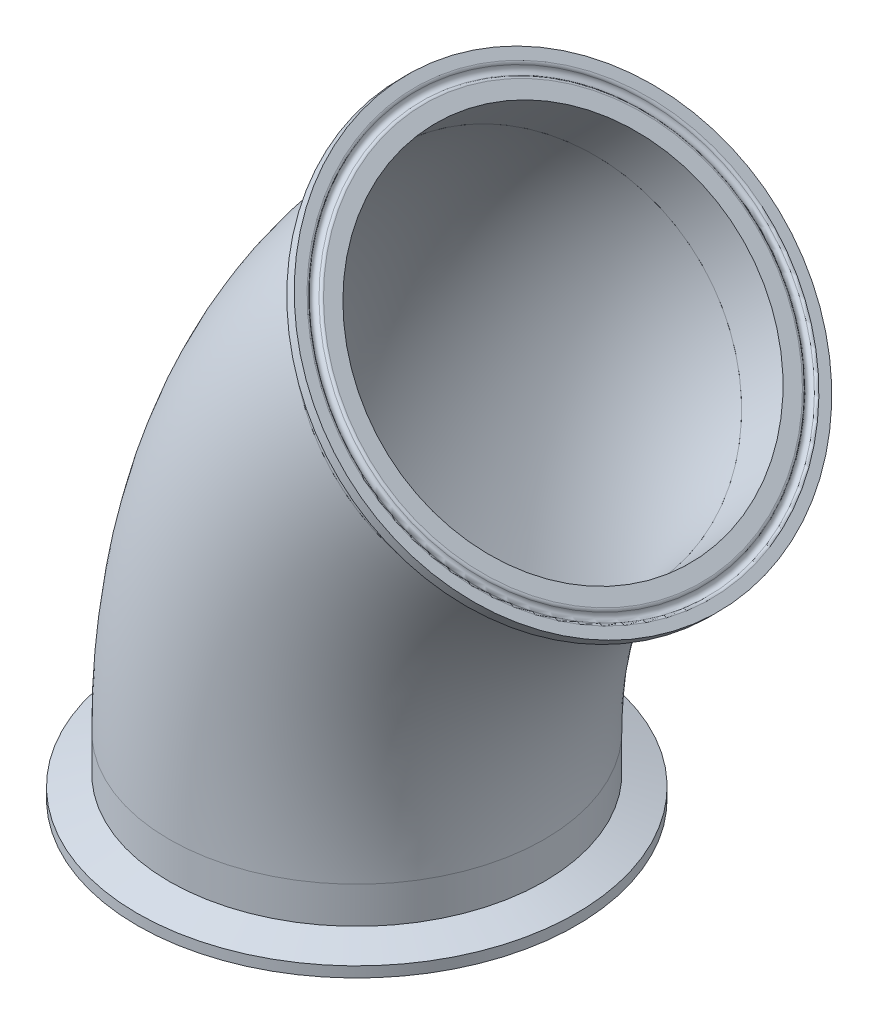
ISO-10303-21;
HEADER;
FILE_DESCRIPTION(('STEP AP214'),'2;1');
FILE_NAME('part.step','',(''),(''),'','','');
FILE_SCHEMA(('AUTOMOTIVE_DESIGN { 1 0 10303 214 1 1 1 1 }'));
ENDSEC;
DATA;
#1=APPLICATION_CONTEXT('core data for automotive mechanical design processes');
#2=APPLICATION_PROTOCOL_DEFINITION('international standard','automotive_design',2000,#1);
#3=PRODUCT_CONTEXT('',#1,'mechanical');
#4=PRODUCT('Part','Part','',(#3));
#5=PRODUCT_RELATED_PRODUCT_CATEGORY('part','',(#4));
#6=PRODUCT_DEFINITION_FORMATION('','',#4);
#7=PRODUCT_DEFINITION_CONTEXT('part definition',#1,'design');
#8=PRODUCT_DEFINITION('design','',#6,#7);
#9=PRODUCT_DEFINITION_SHAPE('','',#8);
#10=(LENGTH_UNIT() NAMED_UNIT(*) SI_UNIT(.MILLI.,.METRE.));
#11=(NAMED_UNIT(*) PLANE_ANGLE_UNIT() SI_UNIT($,.RADIAN.));
#12=(NAMED_UNIT(*) SI_UNIT($,.STERADIAN.) SOLID_ANGLE_UNIT());
#13=UNCERTAINTY_MEASURE_WITH_UNIT(LENGTH_MEASURE(1.E-05),#10,'distance_accuracy_value','');
#14=(GEOMETRIC_REPRESENTATION_CONTEXT(3) GLOBAL_UNCERTAINTY_ASSIGNED_CONTEXT((#13)) GLOBAL_UNIT_ASSIGNED_CONTEXT((#10,
#11,#12)) REPRESENTATION_CONTEXT('',''));
#15=CARTESIAN_POINT('',(0.,0.,0.));
#16=DIRECTION('',(0.,0.,1.));
#17=DIRECTION('',(1.,0.,0.));
#18=AXIS2_PLACEMENT_3D('',#15,#16,#17);
#19=CARTESIAN_POINT('',(86.4752113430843,123.154326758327,89.4574907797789));
#20=DIRECTION('',(0.707106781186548,0.707106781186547,0.));
#21=DIRECTION('',(0.70566039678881,-0.705660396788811,-0.063928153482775));
#22=AXIS2_PLACEMENT_3D('',#19,#20,#21);
#23=TOROIDAL_SURFACE('',#22,56.6185084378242,0.787400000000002);
#24=CARTESIAN_POINT('',(87.0319872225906,123.711102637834,89.4574907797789));
#25=DIRECTION('',(0.707106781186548,0.707106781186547,0.));
#26=DIRECTION('',(0.70566039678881,-0.705660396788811,-0.063928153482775));
#27=AXIS2_PLACEMENT_3D('',#24,#25,#26);
#28=CIRCLE('',#27,56.6185084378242);
#29=CARTESIAN_POINT('',(126.985426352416,83.7576635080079,85.8379740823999));
#30=VERTEX_POINT('',#29);
#31=EDGE_CURVE('P0_E48',#30,#30,#28,.T.);
#32=ORIENTED_EDGE('',*,*,#31,.T.);
#33=EDGE_LOOP('',(#32));
#34=FACE_BOUND('',#33,.T.);
#35=CARTESIAN_POINT('',(86.6964940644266,123.37560947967,89.4574907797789));
#36=DIRECTION('',(0.707106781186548,0.707106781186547,0.));
#37=DIRECTION('',(0.70566039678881,-0.705660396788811,-0.063928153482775));
#38=AXIS2_PLACEMENT_3D('',#35,#36,#37);
#39=CIRCLE('',#38,55.8959666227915);
#40=CARTESIAN_POINT('',(126.14006405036,83.9320394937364,85.8841648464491));
#41=VERTEX_POINT('',#40);
#42=EDGE_CURVE('P0_E9',#41,#41,#39,.T.);
#43=ORIENTED_EDGE('',*,*,#42,.F.);
#44=EDGE_LOOP('',(#43));
#45=FACE_BOUND('',#44,.T.);
#46=ADVANCED_FACE('P0_F14',(#34,#45),#23,.T.);
#47=CARTESIAN_POINT('',(87.0319872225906,123.711102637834,89.4574907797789));
#48=DIRECTION('',(0.707106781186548,0.707106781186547,0.));
#49=DIRECTION('',(0.70566039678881,-0.705660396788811,-0.063928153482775));
#50=AXIS2_PLACEMENT_3D('',#47,#48,#49);
#51=TOROIDAL_SURFACE('',#50,54.8005,1.1938);
#52=CARTESIAN_POINT('',(86.6964940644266,123.37560947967,89.4574907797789));
#53=DIRECTION('',(0.707106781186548,0.707106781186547,0.));
#54=DIRECTION('',(0.70566039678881,-0.705660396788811,-0.063928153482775));
#55=AXIS2_PLACEMENT_3D('',#52,#53,#54);
#56=CIRCLE('',#55,53.7050333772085);
#57=CARTESIAN_POINT('',(124.594009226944,85.4780943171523,86.0242271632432));
#58=VERTEX_POINT('',#57);
#59=EDGE_CURVE('P0_E20',#58,#58,#56,.T.);
#60=ORIENTED_EDGE('',*,*,#59,.F.);
#61=EDGE_LOOP('',(#60));
#62=FACE_BOUND('',#61,.T.);
#63=ORIENTED_EDGE('',*,*,#42,.T.);
#64=EDGE_LOOP('',(#63));
#65=FACE_BOUND('',#64,.T.);
#66=ADVANCED_FACE('P0_F97',(#62,#65),#51,.F.);
#67=CARTESIAN_POINT('',(86.4752113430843,123.154326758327,89.4574907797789));
#68=DIRECTION('',(0.707106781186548,0.707106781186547,0.));
#69=DIRECTION('',(0.70566039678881,-0.705660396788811,-0.063928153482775));
#70=AXIS2_PLACEMENT_3D('',#67,#68,#69);
#71=TOROIDAL_SURFACE('',#70,52.9824915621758,0.787399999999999);
#72=ORIENTED_EDGE('',*,*,#59,.T.);
#73=EDGE_LOOP('',(#72));
#74=FACE_BOUND('',#73,.T.);
#75=CARTESIAN_POINT('',(87.0319872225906,123.711102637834,89.4574907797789));
#76=DIRECTION('',(0.707106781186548,0.707106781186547,0.));
#77=DIRECTION('',(0.70566039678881,-0.705660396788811,-0.063928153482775));
#78=AXIS2_PLACEMENT_3D('',#75,#76,#77);
#79=CIRCLE('',#78,52.9824915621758);
#80=CARTESIAN_POINT('',(124.419633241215,86.3234566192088,86.0704179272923));
#81=VERTEX_POINT('',#80);
#82=EDGE_CURVE('P0_E24',#81,#81,#79,.T.);
#83=ORIENTED_EDGE('',*,*,#82,.F.);
#84=EDGE_LOOP('',(#83));
#85=FACE_BOUND('',#84,.T.);
#86=ADVANCED_FACE('P0_F93',(#74,#85),#71,.T.);
#87=CARTESIAN_POINT('',(87.0319872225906,123.711102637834,89.4574907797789));
#88=DIRECTION('',(-0.707106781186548,-0.707106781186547,0.));
#89=DIRECTION('',(-0.70566039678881,0.705660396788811,0.063928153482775));
#90=AXIS2_PLACEMENT_3D('',#87,#88,#89);
#91=PLANE('',#90);
#92=CARTESIAN_POINT('',(87.0319872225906,123.711102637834,89.4574907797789));
#93=DIRECTION('',(0.707106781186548,0.707106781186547,0.));
#94=DIRECTION('',(0.70566039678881,-0.705660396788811,-0.063928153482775));
#95=AXIS2_PLACEMENT_3D('',#92,#93,#94);
#96=CIRCLE('',#95,48.6918);
#97=CARTESIAN_POINT('',(121.391862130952,89.3512277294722,86.3447139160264));
#98=VERTEX_POINT('',#97);
#99=EDGE_CURVE('P0_E28',#98,#98,#96,.T.);
#100=ORIENTED_EDGE('',*,*,#99,.F.);
#101=EDGE_LOOP('',(#100));
#102=FACE_BOUND('',#101,.T.);
#103=ORIENTED_EDGE('',*,*,#82,.T.);
#104=EDGE_LOOP('',(#103));
#105=FACE_BOUND('',#104,.T.);
#106=ADVANCED_FACE('P0_F86',(#102,#105),#91,.F.);
#107=CARTESIAN_POINT('',(87.0319872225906,123.711102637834,89.4574907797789));
#108=DIRECTION('',(0.707106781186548,0.707106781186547,0.));
#109=DIRECTION('',(0.70566039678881,-0.705660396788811,-0.063928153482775));
#110=AXIS2_PLACEMENT_3D('',#107,#108,#109);
#111=CYLINDRICAL_SURFACE('',#110,48.6918);
#112=ORIENTED_EDGE('',*,*,#99,.T.);
#113=EDGE_LOOP('',(#112));
#114=FACE_BOUND('',#113,.T.);
#115=CARTESIAN_POINT('',(75.8066670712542,112.485782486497,89.4574907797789));
#116=DIRECTION('',(0.707106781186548,0.707106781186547,0.));
#117=DIRECTION('',(0.70566039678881,-0.705660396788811,-0.063928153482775));
#118=AXIS2_PLACEMENT_3D('',#115,#116,#117);
#119=CIRCLE('',#118,48.6918);
#120=CARTESIAN_POINT('',(110.166541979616,78.1259075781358,86.3447139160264));
#121=VERTEX_POINT('',#120);
#122=EDGE_CURVE('P0_E33',#121,#121,#119,.T.);
#123=ORIENTED_EDGE('',*,*,#122,.F.);
#124=EDGE_LOOP('',(#123));
#125=FACE_BOUND('',#124,.T.);
#126=ADVANCED_FACE('P0_F81',(#114,#125),#111,.F.);
#127=CARTESIAN_POINT('',(75.8066670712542,112.485782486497,89.4574907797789));
#128=DIRECTION('',(0.707106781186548,0.707106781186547,0.));
#129=DIRECTION('',(0.70566039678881,-0.705660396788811,-0.063928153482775));
#130=AXIS2_PLACEMENT_3D('',#127,#128,#129);
#131=PLANE('',#130);
#132=CARTESIAN_POINT('',(75.8066670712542,112.485782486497,89.4574907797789));
#133=DIRECTION('',(0.707106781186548,0.707106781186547,0.));
#134=DIRECTION('',(0.70566039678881,-0.705660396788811,-0.063928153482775));
#135=AXIS2_PLACEMENT_3D('',#132,#133,#134);
#136=CIRCLE('',#135,50.8);
#137=CARTESIAN_POINT('',(111.654215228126,76.6382343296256,86.209940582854));
#138=VERTEX_POINT('',#137);
#139=EDGE_CURVE('P0_E36',#138,#138,#136,.T.);
#140=ORIENTED_EDGE('',*,*,#139,.F.);
#141=EDGE_LOOP('',(#140));
#142=FACE_BOUND('',#141,.T.);
#143=ORIENTED_EDGE('',*,*,#122,.T.);
#144=EDGE_LOOP('',(#143));
#145=FACE_BOUND('',#144,.T.);
#146=ADVANCED_FACE('P0_F75',(#142,#145),#131,.F.);
#147=CARTESIAN_POINT('',(87.0319872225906,123.711102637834,89.4574907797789));
#148=DIRECTION('',(0.707106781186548,0.707106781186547,0.));
#149=DIRECTION('',(0.70566039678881,-0.705660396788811,-0.063928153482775));
#150=AXIS2_PLACEMENT_3D('',#147,#148,#149);
#151=CYLINDRICAL_SURFACE('',#150,50.8);
#152=CARTESIAN_POINT('',(82.7912615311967,119.47037694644,89.4574907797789));
#153=DIRECTION('',(0.707106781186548,0.707106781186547,0.));
#154=DIRECTION('',(0.70566039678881,-0.705660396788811,-0.063928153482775));
#155=AXIS2_PLACEMENT_3D('',#152,#153,#154);
#156=CIRCLE('',#155,50.8);
#157=CARTESIAN_POINT('',(118.638809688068,83.6228287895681,86.209940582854));
#158=VERTEX_POINT('',#157);
#159=EDGE_CURVE('P0_E39',#158,#158,#156,.T.);
#160=ORIENTED_EDGE('',*,*,#159,.F.);
#161=EDGE_LOOP('',(#160));
#162=FACE_BOUND('',#161,.T.);
#163=ORIENTED_EDGE('',*,*,#139,.T.);
#164=EDGE_LOOP('',(#163));
#165=FACE_BOUND('',#164,.T.);
#166=ADVANCED_FACE('P0_F69',(#162,#165),#151,.T.);
#167=CARTESIAN_POINT('',(82.7912615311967,119.47037694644,89.4574907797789));
#168=DIRECTION('',(0.707106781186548,0.707106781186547,0.));
#169=DIRECTION('',(0.70566039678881,-0.705660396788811,-0.063928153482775));
#170=AXIS2_PLACEMENT_3D('',#167,#168,#169);
#171=CONICAL_SURFACE('',#170,50.8,1.22173047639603);
#172=CARTESIAN_POINT('',(85.0204098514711,121.699525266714,89.4574907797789));
#173=DIRECTION('',(0.707106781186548,0.707106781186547,0.));
#174=DIRECTION('',(0.70566039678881,-0.705660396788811,-0.063928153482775));
#175=AXIS2_PLACEMENT_3D('',#172,#173,#174);
#176=CIRCLE('',#175,59.4614);
#177=CARTESIAN_POINT('',(126.979964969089,79.7399701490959,85.6562332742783));
#178=VERTEX_POINT('',#177);
#179=EDGE_CURVE('P0_E42',#178,#178,#176,.T.);
#180=ORIENTED_EDGE('',*,*,#179,.F.);
#181=EDGE_LOOP('',(#180));
#182=FACE_BOUND('',#181,.T.);
#183=ORIENTED_EDGE('',*,*,#159,.T.);
#184=EDGE_LOOP('',(#183));
#185=FACE_BOUND('',#184,.T.);
#186=ADVANCED_FACE('P0_F63',(#182,#185),#171,.T.);
#187=CARTESIAN_POINT('',(87.0319872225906,123.711102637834,89.4574907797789));
#188=DIRECTION('',(0.707106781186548,0.707106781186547,0.));
#189=DIRECTION('',(0.70566039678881,-0.705660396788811,-0.063928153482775));
#190=AXIS2_PLACEMENT_3D('',#187,#188,#189);
#191=CYLINDRICAL_SURFACE('',#190,59.4614);
#192=CARTESIAN_POINT('',(87.0319872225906,123.711102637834,89.4574907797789));
#193=DIRECTION('',(0.707106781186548,0.707106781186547,0.));
#194=DIRECTION('',(0.70566039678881,-0.705660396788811,-0.063928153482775));
#195=AXIS2_PLACEMENT_3D('',#192,#193,#194);
#196=CIRCLE('',#195,59.4614);
#197=CARTESIAN_POINT('',(128.991542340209,81.7515475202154,85.6562332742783));
#198=VERTEX_POINT('',#197);
#199=EDGE_CURVE('P0_E45',#198,#198,#196,.T.);
#200=ORIENTED_EDGE('',*,*,#199,.F.);
#201=EDGE_LOOP('',(#200));
#202=FACE_BOUND('',#201,.T.);
#203=ORIENTED_EDGE('',*,*,#179,.T.);
#204=EDGE_LOOP('',(#203));
#205=FACE_BOUND('',#204,.T.);
#206=ADVANCED_FACE('P0_F57',(#202,#205),#191,.T.);
#207=CARTESIAN_POINT('',(87.0319872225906,123.711102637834,89.4574907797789));
#208=DIRECTION('',(-0.707106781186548,-0.707106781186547,0.));
#209=DIRECTION('',(-0.70566039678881,0.705660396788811,0.063928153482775));
#210=AXIS2_PLACEMENT_3D('',#207,#208,#209);
#211=PLANE('',#210);
#212=ORIENTED_EDGE('',*,*,#31,.F.);
#213=EDGE_LOOP('',(#212));
#214=FACE_BOUND('',#213,.T.);
#215=ORIENTED_EDGE('',*,*,#199,.T.);
#216=EDGE_LOOP('',(#215));
#217=FACE_BOUND('',#216,.T.);
#218=ADVANCED_FACE('P0_F54',(#214,#217),#211,.F.);
#219=CLOSED_SHELL('',(#46,#66,#86,#106,#126,#146,#166,#186,#206,#218));
#220=MANIFOLD_SOLID_BREP('P0_B1',#219);
#221=CARTESIAN_POINT('',(31.1697405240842,-10.3648909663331,89.4574907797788));
#222=DIRECTION('',(0.,-1.,0.));
#223=DIRECTION('',(0.,0.,-1.));
#224=AXIS2_PLACEMENT_3D('',#221,#222,#223);
#225=TOROIDAL_SURFACE('',#224,56.6185084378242,0.787400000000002);
#226=CARTESIAN_POINT('',(31.1697405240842,-11.1522909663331,89.4574907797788));
#227=DIRECTION('',(0.,-1.,0.));
#228=DIRECTION('',(0.,0.,-1.));
#229=AXIS2_PLACEMENT_3D('',#226,#227,#228);
#230=CIRCLE('',#229,56.6185084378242);
#231=CARTESIAN_POINT('',(31.1697405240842,-11.1522909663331,32.8389823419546));
#232=VERTEX_POINT('',#231);
#233=EDGE_CURVE('P1_E49',#232,#232,#230,.T.);
#234=ORIENTED_EDGE('',*,*,#233,.T.);
#235=EDGE_LOOP('',(#234));
#236=FACE_BOUND('',#235,.T.);
#237=CARTESIAN_POINT('',(31.1697405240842,-10.6778319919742,89.4574907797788));
#238=DIRECTION('',(0.,-1.,0.));
#239=DIRECTION('',(0.,0.,-1.));
#240=AXIS2_PLACEMENT_3D('',#237,#238,#239);
#241=CIRCLE('',#240,55.8959666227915);
#242=CARTESIAN_POINT('',(31.1697405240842,-10.6778319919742,33.5615241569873));
#243=VERTEX_POINT('',#242);
#244=EDGE_CURVE('P1_E10',#243,#243,#241,.T.);
#245=ORIENTED_EDGE('',*,*,#244,.F.);
#246=EDGE_LOOP('',(#245));
#247=FACE_BOUND('',#246,.T.);
#248=ADVANCED_FACE('P1_F15',(#236,#247),#225,.T.);
#249=CARTESIAN_POINT('',(31.1697405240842,-11.1522909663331,89.4574907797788));
#250=DIRECTION('',(0.,-1.,0.));
#251=DIRECTION('',(0.,0.,-1.));
#252=AXIS2_PLACEMENT_3D('',#249,#250,#251);
#253=TOROIDAL_SURFACE('',#252,54.8005,1.1938);
#254=CARTESIAN_POINT('',(31.1697405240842,-10.6778319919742,89.4574907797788));
#255=DIRECTION('',(0.,-1.,0.));
#256=DIRECTION('',(0.,0.,-1.));
#257=AXIS2_PLACEMENT_3D('',#254,#255,#256);
#258=CIRCLE('',#257,53.7050333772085);
#259=CARTESIAN_POINT('',(31.1697405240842,-10.6778319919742,35.7524574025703));
#260=VERTEX_POINT('',#259);
#261=EDGE_CURVE('P1_E21',#260,#260,#258,.T.);
#262=ORIENTED_EDGE('',*,*,#261,.F.);
#263=EDGE_LOOP('',(#262));
#264=FACE_BOUND('',#263,.T.);
#265=ORIENTED_EDGE('',*,*,#244,.T.);
#266=EDGE_LOOP('',(#265));
#267=FACE_BOUND('',#266,.T.);
#268=ADVANCED_FACE('P1_F98',(#264,#267),#253,.F.);
#269=CARTESIAN_POINT('',(31.1697405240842,-10.3648909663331,89.4574907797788));
#270=DIRECTION('',(0.,-1.,0.));
#271=DIRECTION('',(0.,0.,-1.));
#272=AXIS2_PLACEMENT_3D('',#269,#270,#271);
#273=TOROIDAL_SURFACE('',#272,52.9824915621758,0.787399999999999);
#274=ORIENTED_EDGE('',*,*,#261,.T.);
#275=EDGE_LOOP('',(#274));
#276=FACE_BOUND('',#275,.T.);
#277=CARTESIAN_POINT('',(31.1697405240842,-11.1522909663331,89.4574907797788));
#278=DIRECTION('',(0.,-1.,0.));
#279=DIRECTION('',(0.,0.,-1.));
#280=AXIS2_PLACEMENT_3D('',#277,#278,#279);
#281=CIRCLE('',#280,52.9824915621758);
#282=CARTESIAN_POINT('',(31.1697405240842,-11.1522909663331,36.474999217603));
#283=VERTEX_POINT('',#282);
#284=EDGE_CURVE('P1_E25',#283,#283,#281,.T.);
#285=ORIENTED_EDGE('',*,*,#284,.F.);
#286=EDGE_LOOP('',(#285));
#287=FACE_BOUND('',#286,.T.);
#288=ADVANCED_FACE('P1_F94',(#276,#287),#273,.T.);
#289=CARTESIAN_POINT('',(31.1697405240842,-11.1522909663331,89.4574907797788));
#290=DIRECTION('',(0.,1.,0.));
#291=DIRECTION('',(0.,0.,1.));
#292=AXIS2_PLACEMENT_3D('',#289,#290,#291);
#293=PLANE('',#292);
#294=CARTESIAN_POINT('',(31.1697405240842,-11.1522909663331,89.4574907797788));
#295=DIRECTION('',(0.,-1.,0.));
#296=DIRECTION('',(0.,0.,-1.));
#297=AXIS2_PLACEMENT_3D('',#294,#295,#296);
#298=CIRCLE('',#297,48.6918);
#299=CARTESIAN_POINT('',(31.1697405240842,-11.1522909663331,40.7656907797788));
#300=VERTEX_POINT('',#299);
#301=EDGE_CURVE('P1_E29',#300,#300,#298,.T.);
#302=ORIENTED_EDGE('',*,*,#301,.F.);
#303=EDGE_LOOP('',(#302));
#304=FACE_BOUND('',#303,.T.);
#305=ORIENTED_EDGE('',*,*,#284,.T.);
#306=EDGE_LOOP('',(#305));
#307=FACE_BOUND('',#306,.T.);
#308=ADVANCED_FACE('P1_F87',(#304,#307),#293,.F.);
#309=CARTESIAN_POINT('',(31.1697405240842,-11.1522909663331,89.4574907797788));
#310=DIRECTION('',(0.,-1.,0.));
#311=DIRECTION('',(0.,0.,-1.));
#312=AXIS2_PLACEMENT_3D('',#309,#310,#311);
#313=CYLINDRICAL_SURFACE('',#312,48.6918);
#314=ORIENTED_EDGE('',*,*,#301,.T.);
#315=EDGE_LOOP('',(#314));
#316=FACE_BOUND('',#315,.T.);
#317=CARTESIAN_POINT('',(31.1697405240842,4.72270903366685,89.4574907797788));
#318=DIRECTION('',(0.,-1.,0.));
#319=DIRECTION('',(0.,0.,-1.));
#320=AXIS2_PLACEMENT_3D('',#317,#318,#319);
#321=CIRCLE('',#320,48.6918);
#322=CARTESIAN_POINT('',(31.1697405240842,4.72270903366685,40.7656907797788));
#323=VERTEX_POINT('',#322);
#324=EDGE_CURVE('P1_E34',#323,#323,#321,.T.);
#325=ORIENTED_EDGE('',*,*,#324,.F.);
#326=EDGE_LOOP('',(#325));
#327=FACE_BOUND('',#326,.T.);
#328=ADVANCED_FACE('P1_F82',(#316,#327),#313,.F.);
#329=CARTESIAN_POINT('',(31.1697405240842,4.72270903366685,89.4574907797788));
#330=DIRECTION('',(0.,-1.,0.));
#331=DIRECTION('',(0.,0.,-1.));
#332=AXIS2_PLACEMENT_3D('',#329,#330,#331);
#333=PLANE('',#332);
#334=CARTESIAN_POINT('',(31.1697405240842,4.72270903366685,89.4574907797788));
#335=DIRECTION('',(0.,-1.,0.));
#336=DIRECTION('',(0.,0.,-1.));
#337=AXIS2_PLACEMENT_3D('',#334,#335,#336);
#338=CIRCLE('',#337,50.8);
#339=CARTESIAN_POINT('',(31.1697405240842,4.72270903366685,38.6574907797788));
#340=VERTEX_POINT('',#339);
#341=EDGE_CURVE('P1_E37',#340,#340,#338,.T.);
#342=ORIENTED_EDGE('',*,*,#341,.F.);
#343=EDGE_LOOP('',(#342));
#344=FACE_BOUND('',#343,.T.);
#345=ORIENTED_EDGE('',*,*,#324,.T.);
#346=EDGE_LOOP('',(#345));
#347=FACE_BOUND('',#346,.T.);
#348=ADVANCED_FACE('P1_F76',(#344,#347),#333,.F.);
#349=CARTESIAN_POINT('',(31.1697405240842,-11.1522909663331,89.4574907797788));
#350=DIRECTION('',(0.,-1.,0.));
#351=DIRECTION('',(0.,0.,-1.));
#352=AXIS2_PLACEMENT_3D('',#349,#350,#351);
#353=CYLINDRICAL_SURFACE('',#352,50.8);
#354=CARTESIAN_POINT('',(31.1697405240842,-5.15499917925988,89.4574907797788));
#355=DIRECTION('',(0.,-1.,0.));
#356=DIRECTION('',(0.,0.,-1.));
#357=AXIS2_PLACEMENT_3D('',#354,#355,#356);
#358=CIRCLE('',#357,50.8);
#359=CARTESIAN_POINT('',(31.1697405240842,-5.15499917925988,38.6574907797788));
#360=VERTEX_POINT('',#359);
#361=EDGE_CURVE('P1_E40',#360,#360,#358,.T.);
#362=ORIENTED_EDGE('',*,*,#361,.F.);
#363=EDGE_LOOP('',(#362));
#364=FACE_BOUND('',#363,.T.);
#365=ORIENTED_EDGE('',*,*,#341,.T.);
#366=EDGE_LOOP('',(#365));
#367=FACE_BOUND('',#366,.T.);
#368=ADVANCED_FACE('P1_F70',(#364,#367),#353,.T.);
#369=CARTESIAN_POINT('',(31.1697405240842,-5.15499917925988,89.4574907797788));
#370=DIRECTION('',(0.,-1.,0.));
#371=DIRECTION('',(0.,0.,-1.));
#372=AXIS2_PLACEMENT_3D('',#369,#370,#371);
#373=CONICAL_SURFACE('',#372,50.8,1.22173047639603);
#374=CARTESIAN_POINT('',(31.1697405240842,-8.30749096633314,89.4574907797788));
#375=DIRECTION('',(0.,-1.,0.));
#376=DIRECTION('',(0.,0.,-1.));
#377=AXIS2_PLACEMENT_3D('',#374,#375,#376);
#378=CIRCLE('',#377,59.4614);
#379=CARTESIAN_POINT('',(31.1697405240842,-8.30749096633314,29.9960907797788));
#380=VERTEX_POINT('',#379);
#381=EDGE_CURVE('P1_E43',#380,#380,#378,.T.);
#382=ORIENTED_EDGE('',*,*,#381,.F.);
#383=EDGE_LOOP('',(#382));
#384=FACE_BOUND('',#383,.T.);
#385=ORIENTED_EDGE('',*,*,#361,.T.);
#386=EDGE_LOOP('',(#385));
#387=FACE_BOUND('',#386,.T.);
#388=ADVANCED_FACE('P1_F64',(#384,#387),#373,.T.);
#389=CARTESIAN_POINT('',(31.1697405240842,-11.1522909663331,89.4574907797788));
#390=DIRECTION('',(0.,-1.,0.));
#391=DIRECTION('',(0.,0.,-1.));
#392=AXIS2_PLACEMENT_3D('',#389,#390,#391);
#393=CYLINDRICAL_SURFACE('',#392,59.4614);
#394=CARTESIAN_POINT('',(31.1697405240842,-11.1522909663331,89.4574907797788));
#395=DIRECTION('',(0.,-1.,0.));
#396=DIRECTION('',(0.,0.,-1.));
#397=AXIS2_PLACEMENT_3D('',#394,#395,#396);
#398=CIRCLE('',#397,59.4614);
#399=CARTESIAN_POINT('',(31.1697405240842,-11.1522909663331,29.9960907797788));
#400=VERTEX_POINT('',#399);
#401=EDGE_CURVE('P1_E46',#400,#400,#398,.T.);
#402=ORIENTED_EDGE('',*,*,#401,.F.);
#403=EDGE_LOOP('',(#402));
#404=FACE_BOUND('',#403,.T.);
#405=ORIENTED_EDGE('',*,*,#381,.T.);
#406=EDGE_LOOP('',(#405));
#407=FACE_BOUND('',#406,.T.);
#408=ADVANCED_FACE('P1_F58',(#404,#407),#393,.T.);
#409=CARTESIAN_POINT('',(31.1697405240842,-11.1522909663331,89.4574907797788));
#410=DIRECTION('',(0.,1.,0.));
#411=DIRECTION('',(0.,0.,1.));
#412=AXIS2_PLACEMENT_3D('',#409,#410,#411);
#413=PLANE('',#412);
#414=ORIENTED_EDGE('',*,*,#233,.F.);
#415=EDGE_LOOP('',(#414));
#416=FACE_BOUND('',#415,.T.);
#417=ORIENTED_EDGE('',*,*,#401,.T.);
#418=EDGE_LOOP('',(#417));
#419=FACE_BOUND('',#418,.T.);
#420=ADVANCED_FACE('P1_F55',(#416,#419),#413,.F.);
#421=CLOSED_SHELL('',(#248,#268,#288,#308,#328,#348,#368,#388,#408,#420));
#422=MANIFOLD_SOLID_BREP('P1_B1',#421);
#423=CARTESIAN_POINT('',(183.569740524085,4.72270903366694,89.4574907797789));
#424=DIRECTION('',(0.,0.,1.));
#425=DIRECTION('',(1.,0.,0.));
#426=AXIS2_PLACEMENT_3D('',#423,#424,#425);
#427=TOROIDAL_SURFACE('',#426,152.4,50.8);
#428=CARTESIAN_POINT('',(75.8066670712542,112.485782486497,89.4574907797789));
#429=DIRECTION('',(0.70710678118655,0.707106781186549,0.));
#430=DIRECTION('',(0.,0.,1.));
#431=AXIS2_PLACEMENT_3D('',#428,#429,#430);
#432=CIRCLE('',#431,50.8);
#433=CARTESIAN_POINT('',(39.8856425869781,148.406806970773,89.457490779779));
#434=VERTEX_POINT('',#433);
#435=EDGE_CURVE('P2_E10',#434,#434,#432,.T.);
#436=CARTESIAN_POINT('',(31.1697405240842,4.72270903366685,89.4574907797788));
#437=DIRECTION('',(0.,1.,0.));
#438=DIRECTION('',(0.,0.,1.));
#439=AXIS2_PLACEMENT_3D('',#436,#437,#438);
#440=CIRCLE('',#439,50.8);
#441=CARTESIAN_POINT('',(-19.6302594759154,4.72270903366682,89.4574907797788));
#442=VERTEX_POINT('',#441);
#443=EDGE_CURVE('P2_E21',#442,#442,#440,.T.);
#444=CARTESIAN_POINT('',(183.569740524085,4.72270903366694,89.4574907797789));
#445=DIRECTION('',(0.,0.,1.));
#446=DIRECTION('',(1.,0.,0.));
#447=AXIS2_PLACEMENT_3D('',#444,#445,#446);
#448=CIRCLE('',#447,203.2);
#449=EDGE_CURVE('',#434,#442,#448,.T.);
#450=ORIENTED_EDGE('',*,*,#435,.F.);
#451=ORIENTED_EDGE('',*,*,#443,.T.);
#452=ORIENTED_EDGE('',*,*,#449,.T.);
#453=ORIENTED_EDGE('',*,*,#449,.F.);
#454=EDGE_LOOP('',(#450,#452,#451,#453));
#455=FACE_BOUND('',#454,.T.);
#456=ADVANCED_FACE('P2_F15',(#455),#427,.T.);
#457=CARTESIAN_POINT('',(75.8066670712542,112.485782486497,89.4574907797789));
#458=DIRECTION('',(0.70710678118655,0.707106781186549,0.));
#459=DIRECTION('',(0.,0.,1.));
#460=AXIS2_PLACEMENT_3D('',#457,#458,#459);
#461=PLANE('',#460);
#462=CARTESIAN_POINT('',(75.8066670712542,112.485782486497,89.4574907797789));
#463=DIRECTION('',(0.70710678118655,0.707106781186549,0.));
#464=DIRECTION('',(-0.707106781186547,0.70710678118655,0.));
#465=AXIS2_PLACEMENT_3D('',#462,#463,#464);
#466=CIRCLE('',#465,48.6918);
#467=CARTESIAN_POINT('',(41.3763651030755,146.916084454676,89.457490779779));
#468=VERTEX_POINT('',#467);
#469=EDGE_CURVE('P2_E25',#468,#468,#466,.T.);
#470=ORIENTED_EDGE('',*,*,#469,.F.);
#471=EDGE_LOOP('',(#470));
#472=FACE_BOUND('',#471,.T.);
#473=ORIENTED_EDGE('',*,*,#435,.T.);
#474=EDGE_LOOP('',(#473));
#475=FACE_BOUND('',#474,.T.);
#476=ADVANCED_FACE('P2_F46',(#472,#475),#461,.T.);
#477=CARTESIAN_POINT('',(31.1697405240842,4.72270903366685,89.4574907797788));
#478=DIRECTION('',(0.,1.,0.));
#479=DIRECTION('',(0.,0.,1.));
#480=AXIS2_PLACEMENT_3D('',#477,#478,#479);
#481=PLANE('',#480);
#482=CARTESIAN_POINT('',(31.1697405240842,4.72270903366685,89.4574907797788));
#483=DIRECTION('',(0.,1.,0.));
#484=DIRECTION('',(0.,0.,1.));
#485=AXIS2_PLACEMENT_3D('',#482,#483,#484);
#486=CIRCLE('',#485,48.6918);
#487=CARTESIAN_POINT('',(-17.5220594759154,4.72270903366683,89.4574907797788));
#488=VERTEX_POINT('',#487);
#489=EDGE_CURVE('P2_E29',#488,#488,#486,.T.);
#490=ORIENTED_EDGE('',*,*,#489,.T.);
#491=EDGE_LOOP('',(#490));
#492=FACE_BOUND('',#491,.T.);
#493=ORIENTED_EDGE('',*,*,#443,.F.);
#494=EDGE_LOOP('',(#493));
#495=FACE_BOUND('',#494,.T.);
#496=ADVANCED_FACE('P2_F35',(#492,#495),#481,.F.);
#497=CARTESIAN_POINT('',(183.569740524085,4.72270903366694,89.4574907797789));
#498=DIRECTION('',(0.,0.,1.));
#499=DIRECTION('',(1.,0.,0.));
#500=AXIS2_PLACEMENT_3D('',#497,#498,#499);
#501=TOROIDAL_SURFACE('',#500,152.4,48.6918);
#502=CARTESIAN_POINT('',(183.569740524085,4.72270903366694,89.4574907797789));
#503=DIRECTION('',(0.,0.,1.));
#504=DIRECTION('',(1.,0.,0.));
#505=AXIS2_PLACEMENT_3D('',#502,#503,#504);
#506=CIRCLE('',#505,201.0918);
#507=EDGE_CURVE('',#468,#488,#506,.T.);
#508=ORIENTED_EDGE('',*,*,#469,.T.);
#509=ORIENTED_EDGE('',*,*,#489,.F.);
#510=ORIENTED_EDGE('',*,*,#507,.T.);
#511=ORIENTED_EDGE('',*,*,#507,.F.);
#512=EDGE_LOOP('',(#508,#510,#509,#511));
#513=FACE_BOUND('',#512,.T.);
#514=ADVANCED_FACE('P2_F38',(#513),#501,.F.);
#515=CLOSED_SHELL('',(#456,#476,#496,#514));
#516=MANIFOLD_SOLID_BREP('P2_B1',#515);
#517=ADVANCED_BREP_SHAPE_REPRESENTATION('',(#18,#220,#422,#516),#14);
#518=SHAPE_DEFINITION_REPRESENTATION(#9,#517);
ENDSEC;
END-ISO-10303-21;
